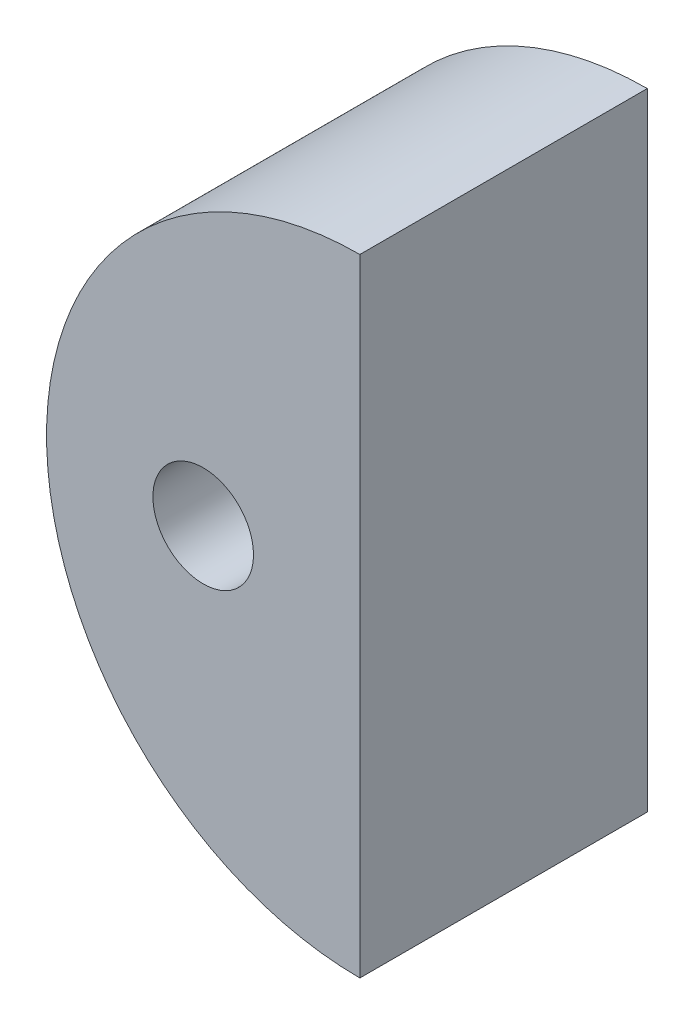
from build123d import *

# Parameters (mm, degrees)
ESQUISSE1_R        = 1.75
BOSS_EXTRU_1_DEPTH = 10


with BuildPart() as part:
    # Esquisse1 → Boss.-Extru.1 (new body)
    with BuildSketch(Plane.XY):
        with BuildLine():
            Line((-30, 6.3), (-30, -15.5))
            ThreePointArc((-30, -15.5), (-40.9, -4.6), (-30, 6.3))
        make_face()
        with Locations((-35.45, -4.6)):
            Circle(ESQUISSE1_R, mode=Mode.SUBTRACT)
    extrude(amount=BOSS_EXTRU_1_DEPTH)


solid = part.part
